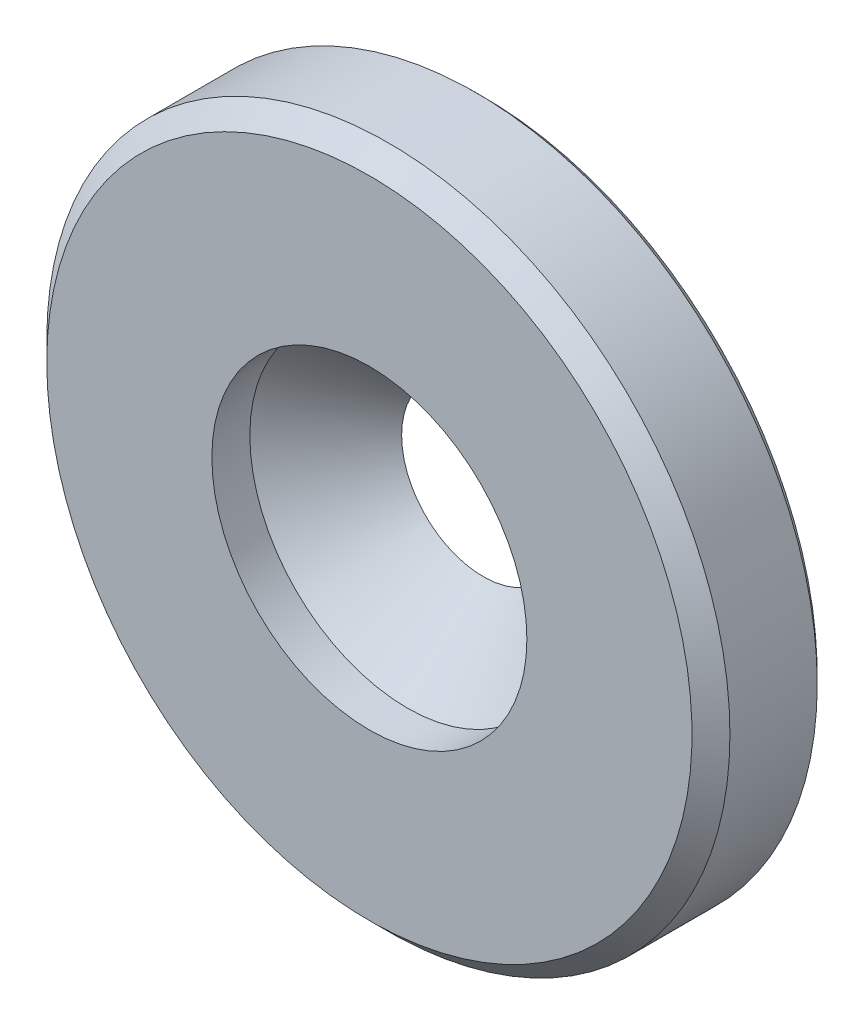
ISO-10303-21;
HEADER;
FILE_DESCRIPTION(('STEP AP214'),'2;1');
FILE_NAME('part.step','',(''),(''),'','','');
FILE_SCHEMA(('AUTOMOTIVE_DESIGN { 1 0 10303 214 1 1 1 1 }'));
ENDSEC;
DATA;
#1=APPLICATION_CONTEXT('core data for automotive mechanical design processes');
#2=APPLICATION_PROTOCOL_DEFINITION('international standard','automotive_design',2000,#1);
#3=PRODUCT_CONTEXT('',#1,'mechanical');
#4=PRODUCT('Part','Part','',(#3));
#5=PRODUCT_RELATED_PRODUCT_CATEGORY('part','',(#4));
#6=PRODUCT_DEFINITION_FORMATION('','',#4);
#7=PRODUCT_DEFINITION_CONTEXT('part definition',#1,'design');
#8=PRODUCT_DEFINITION('design','',#6,#7);
#9=PRODUCT_DEFINITION_SHAPE('','',#8);
#10=(LENGTH_UNIT() NAMED_UNIT(*) SI_UNIT(.MILLI.,.METRE.));
#11=(NAMED_UNIT(*) PLANE_ANGLE_UNIT() SI_UNIT($,.RADIAN.));
#12=(NAMED_UNIT(*) SI_UNIT($,.STERADIAN.) SOLID_ANGLE_UNIT());
#13=UNCERTAINTY_MEASURE_WITH_UNIT(LENGTH_MEASURE(1.E-05),#10,'distance_accuracy_value','');
#14=(GEOMETRIC_REPRESENTATION_CONTEXT(3) GLOBAL_UNCERTAINTY_ASSIGNED_CONTEXT((#13)) GLOBAL_UNIT_ASSIGNED_CONTEXT((#10,
#11,#12)) REPRESENTATION_CONTEXT('',''));
#15=CARTESIAN_POINT('',(0.,0.,0.));
#16=DIRECTION('',(0.,0.,1.));
#17=DIRECTION('',(1.,0.,0.));
#18=AXIS2_PLACEMENT_3D('',#15,#16,#17);
#19=CARTESIAN_POINT('',(0.,0.,0.));
#20=DIRECTION('',(0.,0.,1.));
#21=DIRECTION('',(1.,0.,0.));
#22=AXIS2_PLACEMENT_3D('',#19,#20,#21);
#23=CONICAL_SURFACE('',#22,8.8,0.785398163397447);
#24=CARTESIAN_POINT('',(0.,0.,0.200000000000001));
#25=DIRECTION('',(0.,0.,-1.));
#26=DIRECTION('',(-1.,0.,0.));
#27=AXIS2_PLACEMENT_3D('',#24,#25,#26);
#28=CIRCLE('',#27,9.);
#29=CARTESIAN_POINT('',(-9.00000000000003,0.,0.200000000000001));
#30=VERTEX_POINT('',#29);
#31=EDGE_CURVE('E57',#30,#30,#28,.T.);
#32=ORIENTED_EDGE('',*,*,#31,.T.);
#33=EDGE_LOOP('',(#32));
#34=FACE_BOUND('',#33,.T.);
#35=CARTESIAN_POINT('',(0.,0.,0.));
#36=DIRECTION('',(0.,0.,-1.));
#37=DIRECTION('',(-1.,0.,0.));
#38=AXIS2_PLACEMENT_3D('',#35,#36,#37);
#39=CIRCLE('',#38,8.8);
#40=CARTESIAN_POINT('',(-8.80000000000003,0.,0.));
#41=VERTEX_POINT('',#40);
#42=EDGE_CURVE('E10',#41,#41,#39,.T.);
#43=ORIENTED_EDGE('',*,*,#42,.F.);
#44=EDGE_LOOP('',(#43));
#45=FACE_BOUND('',#44,.T.);
#46=ADVANCED_FACE('F32',(#34,#45),#23,.T.);
#47=CARTESIAN_POINT('',(0.,2.15,0.));
#48=DIRECTION('',(0.,0.,-1.));
#49=DIRECTION('',(-1.,0.,0.));
#50=AXIS2_PLACEMENT_3D('',#47,#48,#49);
#51=PLANE('',#50);
#52=ORIENTED_EDGE('',*,*,#42,.T.);
#53=EDGE_LOOP('',(#52));
#54=FACE_BOUND('',#53,.T.);
#55=CARTESIAN_POINT('',(0.,0.,0.));
#56=DIRECTION('',(0.,0.,-1.));
#57=DIRECTION('',(-1.,0.,0.));
#58=AXIS2_PLACEMENT_3D('',#55,#56,#57);
#59=CIRCLE('',#58,2.15);
#60=CARTESIAN_POINT('',(-2.15000000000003,0.,0.));
#61=VERTEX_POINT('',#60);
#62=EDGE_CURVE('E38',#61,#61,#59,.T.);
#63=ORIENTED_EDGE('',*,*,#62,.F.);
#64=EDGE_LOOP('',(#63));
#65=FACE_BOUND('',#64,.T.);
#66=ADVANCED_FACE('F75',(#54,#65),#51,.T.);
#67=CARTESIAN_POINT('',(0.,0.,2.00000000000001));
#68=DIRECTION('',(0.,0.,1.));
#69=DIRECTION('',(1.,0.,0.));
#70=AXIS2_PLACEMENT_3D('',#67,#68,#69);
#71=CONICAL_SURFACE('',#70,4.15000000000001,0.785398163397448);
#72=ORIENTED_EDGE('',*,*,#62,.T.);
#73=EDGE_LOOP('',(#72));
#74=FACE_BOUND('',#73,.T.);
#75=CARTESIAN_POINT('',(0.,0.,2.00000000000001));
#76=DIRECTION('',(0.,0.,-1.));
#77=DIRECTION('',(-1.,0.,0.));
#78=AXIS2_PLACEMENT_3D('',#75,#76,#77);
#79=CIRCLE('',#78,4.15000000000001);
#80=CARTESIAN_POINT('',(-4.15000000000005,0.,2.00000000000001));
#81=VERTEX_POINT('',#80);
#82=EDGE_CURVE('E42',#81,#81,#79,.T.);
#83=ORIENTED_EDGE('',*,*,#82,.F.);
#84=EDGE_LOOP('',(#83));
#85=FACE_BOUND('',#84,.T.);
#86=ADVANCED_FACE('F79',(#74,#85),#71,.F.);
#87=CARTESIAN_POINT('',(0.,0.,0.));
#88=DIRECTION('',(0.,0.,-1.));
#89=DIRECTION('',(-1.,0.,0.));
#90=AXIS2_PLACEMENT_3D('',#87,#88,#89);
#91=CYLINDRICAL_SURFACE('',#90,4.15000000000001);
#92=ORIENTED_EDGE('',*,*,#82,.T.);
#93=EDGE_LOOP('',(#92));
#94=FACE_BOUND('',#93,.T.);
#95=CARTESIAN_POINT('',(0.,0.,3.));
#96=DIRECTION('',(0.,0.,-1.));
#97=DIRECTION('',(-1.,0.,0.));
#98=AXIS2_PLACEMENT_3D('',#95,#96,#97);
#99=CIRCLE('',#98,4.15000000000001);
#100=CARTESIAN_POINT('',(-4.15000000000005,0.,3.));
#101=VERTEX_POINT('',#100);
#102=EDGE_CURVE('E46',#101,#101,#99,.T.);
#103=ORIENTED_EDGE('',*,*,#102,.F.);
#104=EDGE_LOOP('',(#103));
#105=FACE_BOUND('',#104,.T.);
#106=ADVANCED_FACE('F83',(#94,#105),#91,.F.);
#107=CARTESIAN_POINT('',(0.,8.5,3.));
#108=DIRECTION('',(0.,0.,1.));
#109=DIRECTION('',(1.,0.,0.));
#110=AXIS2_PLACEMENT_3D('',#107,#108,#109);
#111=PLANE('',#110);
#112=ORIENTED_EDGE('',*,*,#102,.T.);
#113=EDGE_LOOP('',(#112));
#114=FACE_BOUND('',#113,.T.);
#115=CARTESIAN_POINT('',(0.,0.,3.00000000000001));
#116=DIRECTION('',(0.,0.,-1.));
#117=DIRECTION('',(-1.,0.,0.));
#118=AXIS2_PLACEMENT_3D('',#115,#116,#117);
#119=CIRCLE('',#118,8.5);
#120=CARTESIAN_POINT('',(-8.50000000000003,0.,3.00000000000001));
#121=VERTEX_POINT('',#120);
#122=EDGE_CURVE('E51',#121,#121,#119,.T.);
#123=ORIENTED_EDGE('',*,*,#122,.F.);
#124=EDGE_LOOP('',(#123));
#125=FACE_BOUND('',#124,.T.);
#126=ADVANCED_FACE('F71',(#114,#125),#111,.T.);
#127=CARTESIAN_POINT('',(0.,0.,2.5));
#128=DIRECTION('',(0.,0.,-1.));
#129=DIRECTION('',(-1.,0.,0.));
#130=AXIS2_PLACEMENT_3D('',#127,#128,#129);
#131=CONICAL_SURFACE('',#130,9.,0.785398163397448);
#132=ORIENTED_EDGE('',*,*,#122,.T.);
#133=EDGE_LOOP('',(#132));
#134=FACE_BOUND('',#133,.T.);
#135=CARTESIAN_POINT('',(0.,0.,2.5));
#136=DIRECTION('',(0.,0.,-1.));
#137=DIRECTION('',(-1.,0.,0.));
#138=AXIS2_PLACEMENT_3D('',#135,#136,#137);
#139=CIRCLE('',#138,9.);
#140=CARTESIAN_POINT('',(-9.00000000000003,0.,2.5));
#141=VERTEX_POINT('',#140);
#142=EDGE_CURVE('E54',#141,#141,#139,.T.);
#143=ORIENTED_EDGE('',*,*,#142,.F.);
#144=EDGE_LOOP('',(#143));
#145=FACE_BOUND('',#144,.T.);
#146=ADVANCED_FACE('F65',(#134,#145),#131,.T.);
#147=CARTESIAN_POINT('',(0.,0.,0.));
#148=DIRECTION('',(0.,0.,-1.));
#149=DIRECTION('',(-1.,0.,0.));
#150=AXIS2_PLACEMENT_3D('',#147,#148,#149);
#151=CYLINDRICAL_SURFACE('',#150,9.);
#152=ORIENTED_EDGE('',*,*,#142,.T.);
#153=EDGE_LOOP('',(#152));
#154=FACE_BOUND('',#153,.T.);
#155=ORIENTED_EDGE('',*,*,#31,.F.);
#156=EDGE_LOOP('',(#155));
#157=FACE_BOUND('',#156,.T.);
#158=ADVANCED_FACE('F63',(#154,#157),#151,.T.);
#159=CLOSED_SHELL('',(#46,#66,#86,#106,#126,#146,#158));
#160=MANIFOLD_SOLID_BREP('B2',#159);
#161=ADVANCED_BREP_SHAPE_REPRESENTATION('',(#18,#160),#14);
#162=SHAPE_DEFINITION_REPRESENTATION(#9,#161);
ENDSEC;
END-ISO-10303-21;
